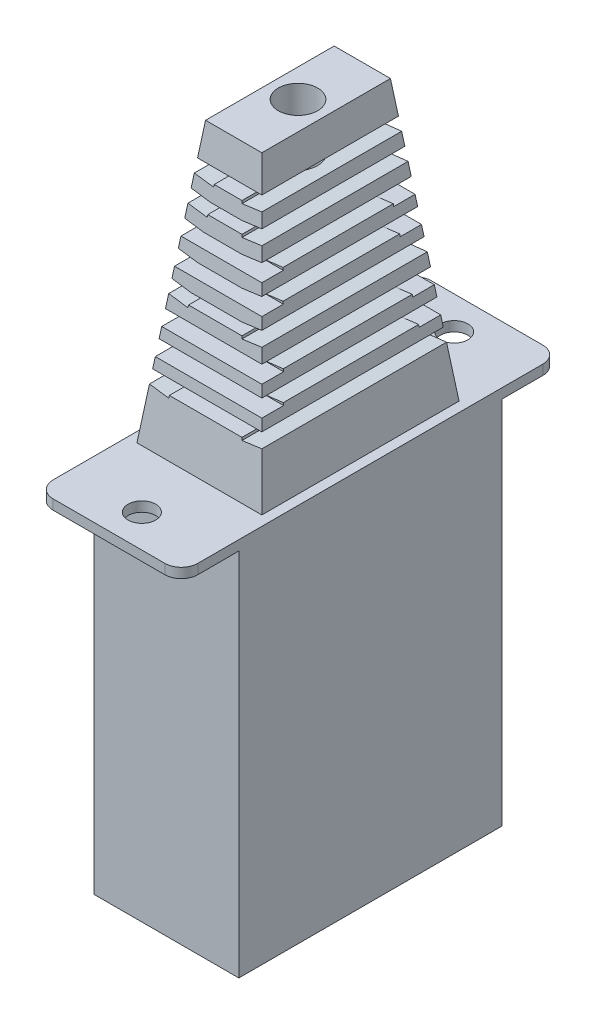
from build123d import *

# Parameters (mm, degrees)
ESQUISSE1_W             = 44
ESQUISSE1_H             = 80
EXTRUSION1_DEPTH        = 112.5
ESQUISSE2_R             = 4.2
EXTRUSION2_DEPTH        = 3
ESQUISSE3_R             = 8
ENL_V_MAT_EXTRU_1_DEPTH = 53
ESQUISSE4_W             = 38
ESQUISSE4_H             = 60
EXTRUSION3_DEPTH        = 85
D_POUILLE2_ANGLE        = 7
ENL_V_MAT_EXTRU_3_DEPTH = 225.032363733
ESQUISSE8_W             = 6.532536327
ESQUISSE8_H             = 3.970184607
ESQUISSE8_W_2           = 6.622318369
ESQUISSE8_H_2           = 4.701400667
ESQUISSE8_W_3           = 6.442754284
ESQUISSE8_H_3           = 3.238968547
ESQUISSE8_W_4           = 6.532536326
ESQUISSE8_W_5           = 6.442754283
ESQUISSE8_H_4           = 3.238968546
ENL_V_MAT_EXTRU_4_DEPTH = 214.172465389
ESQUISSE9_R             = 6
ENL_V_MAT_EXTRU_5_DEPTH = 95


with BuildPart() as part:
    # Esquisse1 → Extrusion1 (new body)
    with BuildSketch(Plane(origin=(0, 0, 0), x_dir=(1, 0, 0), z_dir=(0, 1, 0))):
        Rectangle(ESQUISSE1_W, ESQUISSE1_H)
    extrude(amount=EXTRUSION1_DEPTH)

    # Esquisse2 → Extrusion2 (add)
    with BuildSketch(Plane(origin=(0, 112.5, 0), x_dir=(-1, 0, 0), z_dir=(0, 1, 0))):
        with BuildLine():
            Line((17, -57.5), (-17, -57.5))
            ThreePointArc((-17, -57.5), (-20.535533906, -56.035533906), (-22, -52.5))
            Line((-22, -52.5), (-22, 52.5))
            ThreePointArc((-22, 52.5), (-20.535533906, 56.035533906), (-17, 57.5))
            Line((-17, 57.5), (17, 57.5))
            ThreePointArc((17, 57.5), (20.535533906, 56.035533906), (22, 52.5))
            Line((22, 52.5), (22, -52.5))
            ThreePointArc((22, -52.5), (20.535533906, -56.035533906), (17, -57.5))
        make_face()
        with Locations(Location((0, -47.5, 0), (0, 0, 90))):
            Circle(ESQUISSE2_R, mode=Mode.SUBTRACT)
        with Locations(Location((0, 47.5, 0), (0, 0, 90))):
            Circle(ESQUISSE2_R, mode=Mode.SUBTRACT)
    extrude(amount=EXTRUSION2_DEPTH)

    # Esquisse3 → Enl_v. mat.-Extru.1 (cut)
    with BuildSketch(Plane.XZ):
        with Locations(Location((0, 22.5, 0), (0, 0, 270))):
            Circle(ESQUISSE3_R)
        with Locations(Location((0, -22.5, 0), (0, 0, 270))):
            Circle(ESQUISSE3_R)
    extrude(amount=-ENL_V_MAT_EXTRU_1_DEPTH, mode=Mode.SUBTRACT)

    # Esquisse4 → Extrusion3 (add)
    with BuildSketch(Plane(origin=(0, 115.5, 0), x_dir=(-1, 0, 0), z_dir=(0, 1, 0))):
        Rectangle(ESQUISSE4_W, ESQUISSE4_H)
    extrude(amount=EXTRUSION3_DEPTH)

    # D_pouille2
    d_pouille2_faces = [part.faces().sort_by_distance(p)[0] for p in [
        (-19, 158, 0),
        (0, 158, -30),
        (19, 158, 0),
        (0, 158, 30),
    ]]
    draft(d_pouille2_faces, Plane(origin=(17, 115.5, 52.5), x_dir=(0, 0, 1), z_dir=(0, 1, 0)), D_POUILLE2_ANGLE)

    # Esquisse7 → Enl_v. mat.-Extru.3 (cut, through all)
    with BuildSketch(Plane.XY.offset(40)):
        Polygon((-11.767098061, 190.81827717), (-3.826728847, 189.843322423), (-4.314206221, 185.873137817), (-12.254575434, 186.848092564), align=None)
        Polygon((-5.289160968, 177.932768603), (-4.801683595, 181.90295321), (-12.742052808, 182.877907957), (-13.229530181, 178.907723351), align=None)
        Polygon((-13.717007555, 174.937538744), (-5.776638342, 173.962583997), (-6.264115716, 169.99239939), (-14.204484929, 170.967354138), align=None)
        Polygon((-7.239070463, 162.052030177), (-6.751593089, 166.022214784), (-14.691962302, 166.997169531), (-15.179439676, 163.026984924), align=None)
        Polygon((-15.66691705, 159.056800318), (-7.726547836, 158.081845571), (-8.21402521, 154.111660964), (-16.154394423, 155.086615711), align=None)
        Polygon((-9.188979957, 146.171291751), (-8.701502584, 150.141476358), (-16.641871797, 151.116431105), (-17.12934917, 147.146246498), align=None)
        Polygon((-17.616826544, 143.176061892), (-9.676457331, 142.201107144), (-10.163934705, 138.230922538), (-18.104303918, 139.205877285), align=None)
        Polygon((-11.138889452, 130.290553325), (-10.651412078, 134.260737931), (-18.591781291, 135.235692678), (-19.079258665, 131.265508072), align=None)
        Polygon((19.079258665, 131.265508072), (11.138889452, 130.290553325), (10.651412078, 134.260737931), (18.591781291, 135.235692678), align=None)
        Polygon((9.676457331, 142.201107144), (10.163934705, 138.230922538), (18.104303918, 139.205877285), (17.616826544, 143.176061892), align=None)
        Polygon((17.12934917, 147.146246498), (9.188979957, 146.171291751), (8.701502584, 150.141476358), (16.641871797, 151.116431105), align=None)
        Polygon((7.726547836, 158.081845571), (8.21402521, 154.111660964), (16.154394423, 155.086615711), (15.66691705, 159.056800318), align=None)
        Polygon((15.179439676, 163.026984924), (7.239070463, 162.052030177), (6.751593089, 166.022214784), (14.691962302, 166.997169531), align=None)
        Polygon((5.776638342, 173.962583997), (6.264115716, 169.99239939), (14.204484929, 170.967354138), (13.717007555, 174.937538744), align=None)
        Polygon((13.229530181, 178.907723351), (5.289160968, 177.932768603), (4.801683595, 181.90295321), (12.742052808, 182.877907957), align=None)
        Polygon((3.826728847, 189.843322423), (4.314206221, 185.873137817), (12.254575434, 186.848092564), (11.767098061, 190.81827717), align=None)
    extrude(amount=-ENL_V_MAT_EXTRU_3_DEPTH, mode=Mode.SUBTRACT)

    # Esquisse8 → Enl_v. mat.-Extru.4 (cut, through all)
    with BuildSketch(Plane(origin=(22, 0, 0), x_dir=(0, 0, -1), z_dir=(1, 0, 0))):
        with Locations((-24.827898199, 133.006861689)):
            Rectangle(ESQUISSE8_W, ESQUISSE8_H)
        with Locations((-23.897834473, 140.581622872)):
            Rectangle(ESQUISSE8_W_2, ESQUISSE8_H_2)
        with Locations((-22.922879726, 148.521992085)):
            Rectangle(ESQUISSE8_W_2, ESQUISSE8_H_2)
        with Locations((-21.947924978, 156.462361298)):
            Rectangle(ESQUISSE8_W_3, ESQUISSE8_H_3)
        with Locations((-21.017861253, 164.03712248)):
            Rectangle(ESQUISSE8_W, ESQUISSE8_H)
        with Locations((-20.042906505, 171.977491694)):
            Rectangle(ESQUISSE8_W_4, ESQUISSE8_H)
        with Locations((-19.023060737, 180.283468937)):
            Rectangle(ESQUISSE8_W_5, ESQUISSE8_H_4)
        with Locations((-18.003214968, 188.589446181)):
            Rectangle(ESQUISSE8_W_4, ESQUISSE8_H)
        with Locations((18.003214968, 188.589446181)):
            Rectangle(ESQUISSE8_W_4, ESQUISSE8_H)
        with Locations((19.023060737, 180.283468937)):
            Rectangle(ESQUISSE8_W_5, ESQUISSE8_H_4)
        with Locations((20.042906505, 171.977491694)):
            Rectangle(ESQUISSE8_W_4, ESQUISSE8_H)
        with Locations((21.017861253, 164.03712248)):
            Rectangle(ESQUISSE8_W, ESQUISSE8_H)
        with Locations((21.947924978, 156.462361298)):
            Rectangle(ESQUISSE8_W_3, ESQUISSE8_H_3)
        with Locations((22.922879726, 148.521992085)):
            Rectangle(ESQUISSE8_W_2, ESQUISSE8_H_2)
        with Locations((23.897834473, 140.581622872)):
            Rectangle(ESQUISSE8_W_2, ESQUISSE8_H_2)
        with Locations((24.827898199, 133.006861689)):
            Rectangle(ESQUISSE8_W, ESQUISSE8_H)
    extrude(amount=-ENL_V_MAT_EXTRU_4_DEPTH, mode=Mode.SUBTRACT)

    # Esquisse9 → Enl_v. mat.-Extru.5 (cut)
    with BuildSketch(Plane(origin=(0, 200.5, 0), x_dir=(-1, 0, 0), z_dir=(0, 1, 0))):
        with Locations(Location((0, 0, 0), (0, 0, 90))):
            Circle(ESQUISSE9_R)
    extrude(amount=-ENL_V_MAT_EXTRU_5_DEPTH, mode=Mode.SUBTRACT)


solid = part.part
